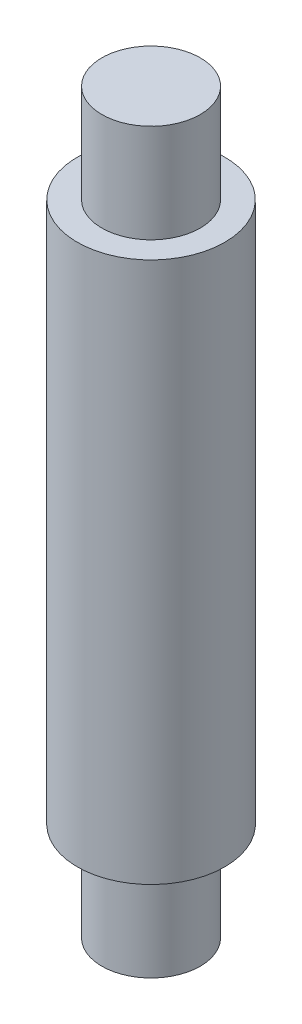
ISO-10303-21;
HEADER;
FILE_DESCRIPTION(('STEP AP214'),'2;1');
FILE_NAME('part.step','',(''),(''),'','','');
FILE_SCHEMA(('AUTOMOTIVE_DESIGN { 1 0 10303 214 1 1 1 1 }'));
ENDSEC;
DATA;
#1=APPLICATION_CONTEXT('core data for automotive mechanical design processes');
#2=APPLICATION_PROTOCOL_DEFINITION('international standard','automotive_design',2000,#1);
#3=PRODUCT_CONTEXT('',#1,'mechanical');
#4=PRODUCT('Part','Part','',(#3));
#5=PRODUCT_RELATED_PRODUCT_CATEGORY('part','',(#4));
#6=PRODUCT_DEFINITION_FORMATION('','',#4);
#7=PRODUCT_DEFINITION_CONTEXT('part definition',#1,'design');
#8=PRODUCT_DEFINITION('design','',#6,#7);
#9=PRODUCT_DEFINITION_SHAPE('','',#8);
#10=(LENGTH_UNIT() NAMED_UNIT(*) SI_UNIT(.MILLI.,.METRE.));
#11=(NAMED_UNIT(*) PLANE_ANGLE_UNIT() SI_UNIT($,.RADIAN.));
#12=(NAMED_UNIT(*) SI_UNIT($,.STERADIAN.) SOLID_ANGLE_UNIT());
#13=UNCERTAINTY_MEASURE_WITH_UNIT(LENGTH_MEASURE(1.E-05),#10,'distance_accuracy_value','');
#14=(GEOMETRIC_REPRESENTATION_CONTEXT(3) GLOBAL_UNCERTAINTY_ASSIGNED_CONTEXT((#13)) GLOBAL_UNIT_ASSIGNED_CONTEXT((#10,
#11,#12)) REPRESENTATION_CONTEXT('',''));
#15=CARTESIAN_POINT('',(0.,0.,0.));
#16=DIRECTION('',(0.,0.,1.));
#17=DIRECTION('',(1.,0.,0.));
#18=AXIS2_PLACEMENT_3D('',#15,#16,#17);
#19=CARTESIAN_POINT('',(-75.,0.,0.));
#20=DIRECTION('',(0.,-1.,0.));
#21=DIRECTION('',(1.,0.,0.));
#22=AXIS2_PLACEMENT_3D('',#19,#20,#21);
#23=PLANE('',#22);
#24=CARTESIAN_POINT('',(-75.,0.,0.));
#25=DIRECTION('',(0.,-1.,0.));
#26=DIRECTION('',(1.,0.,0.));
#27=AXIS2_PLACEMENT_3D('',#24,#25,#26);
#28=CIRCLE('',#27,9.99999999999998);
#29=CARTESIAN_POINT('',(-65.,0.,0.));
#30=VERTEX_POINT('',#29);
#31=EDGE_CURVE('E10',#30,#30,#28,.T.);
#32=ORIENTED_EDGE('',*,*,#31,.T.);
#33=EDGE_LOOP('',(#32));
#34=FACE_BOUND('',#33,.T.);
#35=ADVANCED_FACE('F30',(#34),#23,.T.);
#36=CARTESIAN_POINT('',(-75.,0.,0.));
#37=DIRECTION('',(0.,-1.,0.));
#38=DIRECTION('',(1.,0.,0.));
#39=AXIS2_PLACEMENT_3D('',#36,#37,#38);
#40=CYLINDRICAL_SURFACE('',#39,9.99999999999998);
#41=CARTESIAN_POINT('',(-75.,20.,0.));
#42=DIRECTION('',(0.,-1.,0.));
#43=DIRECTION('',(1.,0.,0.));
#44=AXIS2_PLACEMENT_3D('',#41,#42,#43);
#45=CIRCLE('',#44,9.99999999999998);
#46=CARTESIAN_POINT('',(-65.,20.,0.));
#47=VERTEX_POINT('',#46);
#48=EDGE_CURVE('E36',#47,#47,#45,.T.);
#49=ORIENTED_EDGE('',*,*,#48,.T.);
#50=EDGE_LOOP('',(#49));
#51=FACE_BOUND('',#50,.T.);
#52=ORIENTED_EDGE('',*,*,#31,.F.);
#53=EDGE_LOOP('',(#52));
#54=FACE_BOUND('',#53,.T.);
#55=ADVANCED_FACE('F68',(#51,#54),#40,.T.);
#56=CARTESIAN_POINT('',(-65.,20.,0.));
#57=DIRECTION('',(0.,-1.,0.));
#58=DIRECTION('',(1.,0.,0.));
#59=AXIS2_PLACEMENT_3D('',#56,#57,#58);
#60=PLANE('',#59);
#61=CARTESIAN_POINT('',(-75.,20.,0.));
#62=DIRECTION('',(0.,-1.,0.));
#63=DIRECTION('',(1.,0.,0.));
#64=AXIS2_PLACEMENT_3D('',#61,#62,#63);
#65=CIRCLE('',#64,15.);
#66=CARTESIAN_POINT('',(-60.,20.,0.));
#67=VERTEX_POINT('',#66);
#68=EDGE_CURVE('E40',#67,#67,#65,.T.);
#69=ORIENTED_EDGE('',*,*,#68,.T.);
#70=EDGE_LOOP('',(#69));
#71=FACE_BOUND('',#70,.T.);
#72=ORIENTED_EDGE('',*,*,#48,.F.);
#73=EDGE_LOOP('',(#72));
#74=FACE_BOUND('',#73,.T.);
#75=ADVANCED_FACE('F72',(#71,#74),#60,.T.);
#76=CARTESIAN_POINT('',(-75.,0.,0.));
#77=DIRECTION('',(0.,-1.,0.));
#78=DIRECTION('',(1.,0.,0.));
#79=AXIS2_PLACEMENT_3D('',#76,#77,#78);
#80=CYLINDRICAL_SURFACE('',#79,15.);
#81=CARTESIAN_POINT('',(-75.,130.,0.));
#82=DIRECTION('',(0.,-1.,0.));
#83=DIRECTION('',(1.,0.,0.));
#84=AXIS2_PLACEMENT_3D('',#81,#82,#83);
#85=CIRCLE('',#84,15.);
#86=CARTESIAN_POINT('',(-60.,130.,0.));
#87=VERTEX_POINT('',#86);
#88=EDGE_CURVE('E44',#87,#87,#85,.T.);
#89=ORIENTED_EDGE('',*,*,#88,.T.);
#90=EDGE_LOOP('',(#89));
#91=FACE_BOUND('',#90,.T.);
#92=ORIENTED_EDGE('',*,*,#68,.F.);
#93=EDGE_LOOP('',(#92));
#94=FACE_BOUND('',#93,.T.);
#95=ADVANCED_FACE('F76',(#91,#94),#80,.T.);
#96=CARTESIAN_POINT('',(-60.,130.,0.));
#97=DIRECTION('',(0.,1.,0.));
#98=DIRECTION('',(-1.,0.,0.));
#99=AXIS2_PLACEMENT_3D('',#96,#97,#98);
#100=PLANE('',#99);
#101=CARTESIAN_POINT('',(-75.,130.,0.));
#102=DIRECTION('',(0.,-1.,0.));
#103=DIRECTION('',(1.,0.,0.));
#104=AXIS2_PLACEMENT_3D('',#101,#102,#103);
#105=CIRCLE('',#104,9.99999999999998);
#106=CARTESIAN_POINT('',(-65.,130.,0.));
#107=VERTEX_POINT('',#106);
#108=EDGE_CURVE('E49',#107,#107,#105,.T.);
#109=ORIENTED_EDGE('',*,*,#108,.T.);
#110=EDGE_LOOP('',(#109));
#111=FACE_BOUND('',#110,.T.);
#112=ORIENTED_EDGE('',*,*,#88,.F.);
#113=EDGE_LOOP('',(#112));
#114=FACE_BOUND('',#113,.T.);
#115=ADVANCED_FACE('F65',(#111,#114),#100,.T.);
#116=CARTESIAN_POINT('',(-75.,0.,0.));
#117=DIRECTION('',(0.,-1.,0.));
#118=DIRECTION('',(1.,0.,0.));
#119=AXIS2_PLACEMENT_3D('',#116,#117,#118);
#120=CYLINDRICAL_SURFACE('',#119,9.99999999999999);
#121=CARTESIAN_POINT('',(-75.,150.,0.));
#122=DIRECTION('',(0.,-1.,0.));
#123=DIRECTION('',(1.,0.,0.));
#124=AXIS2_PLACEMENT_3D('',#121,#122,#123);
#125=CIRCLE('',#124,9.99999999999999);
#126=CARTESIAN_POINT('',(-65.,150.,0.));
#127=VERTEX_POINT('',#126);
#128=EDGE_CURVE('E52',#127,#127,#125,.T.);
#129=ORIENTED_EDGE('',*,*,#128,.T.);
#130=EDGE_LOOP('',(#129));
#131=FACE_BOUND('',#130,.T.);
#132=ORIENTED_EDGE('',*,*,#108,.F.);
#133=EDGE_LOOP('',(#132));
#134=FACE_BOUND('',#133,.T.);
#135=ADVANCED_FACE('F56',(#131,#134),#120,.T.);
#136=CARTESIAN_POINT('',(-65.,150.,0.));
#137=DIRECTION('',(0.,1.,0.));
#138=DIRECTION('',(-1.,0.,0.));
#139=AXIS2_PLACEMENT_3D('',#136,#137,#138);
#140=PLANE('',#139);
#141=ORIENTED_EDGE('',*,*,#128,.F.);
#142=EDGE_LOOP('',(#141));
#143=FACE_BOUND('',#142,.T.);
#144=ADVANCED_FACE('F59',(#143),#140,.T.);
#145=CLOSED_SHELL('',(#35,#55,#75,#95,#115,#135,#144));
#146=MANIFOLD_SOLID_BREP('B2',#145);
#147=ADVANCED_BREP_SHAPE_REPRESENTATION('',(#18,#146),#14);
#148=SHAPE_DEFINITION_REPRESENTATION(#9,#147);
ENDSEC;
END-ISO-10303-21;
